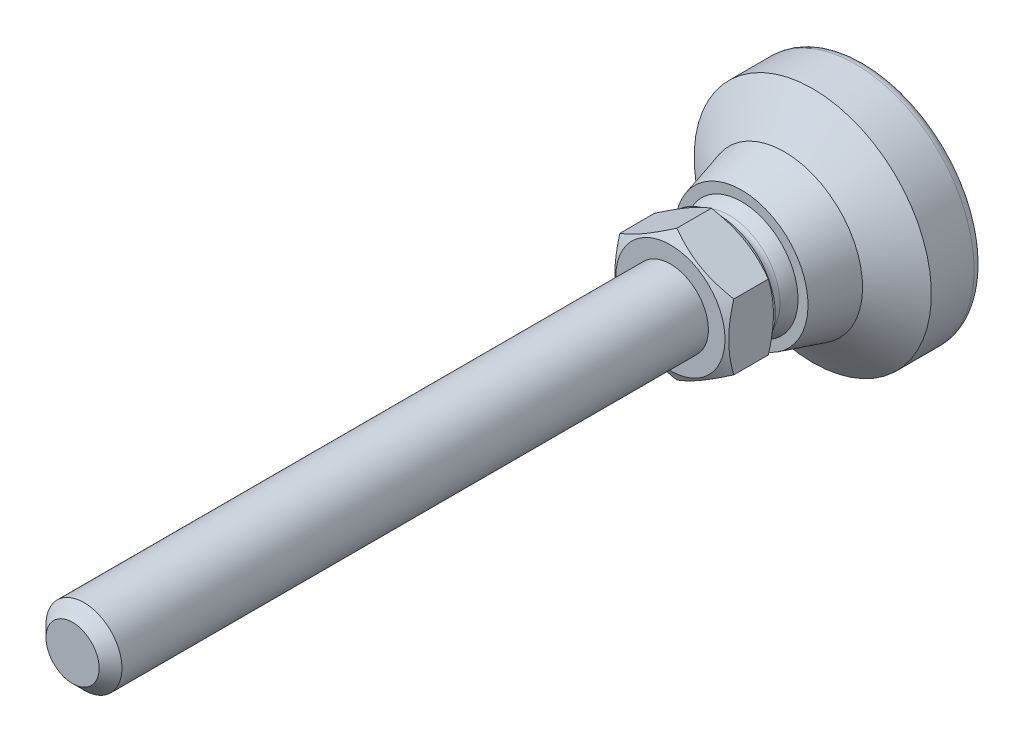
ISO-10303-21;
HEADER;
FILE_DESCRIPTION(('STEP AP214'),'2;1');
FILE_NAME('part.step','',(''),(''),'','','');
FILE_SCHEMA(('AUTOMOTIVE_DESIGN { 1 0 10303 214 1 1 1 1 }'));
ENDSEC;
DATA;
#1=APPLICATION_CONTEXT('core data for automotive mechanical design processes');
#2=APPLICATION_PROTOCOL_DEFINITION('international standard','automotive_design',2000,#1);
#3=PRODUCT_CONTEXT('',#1,'mechanical');
#4=PRODUCT('Part','Part','',(#3));
#5=PRODUCT_RELATED_PRODUCT_CATEGORY('part','',(#4));
#6=PRODUCT_DEFINITION_FORMATION('','',#4);
#7=PRODUCT_DEFINITION_CONTEXT('part definition',#1,'design');
#8=PRODUCT_DEFINITION('design','',#6,#7);
#9=PRODUCT_DEFINITION_SHAPE('','',#8);
#10=(LENGTH_UNIT() NAMED_UNIT(*) SI_UNIT(.MILLI.,.METRE.));
#11=(NAMED_UNIT(*) PLANE_ANGLE_UNIT() SI_UNIT($,.RADIAN.));
#12=(NAMED_UNIT(*) SI_UNIT($,.STERADIAN.) SOLID_ANGLE_UNIT());
#13=UNCERTAINTY_MEASURE_WITH_UNIT(LENGTH_MEASURE(1.E-05),#10,'distance_accuracy_value','');
#14=(GEOMETRIC_REPRESENTATION_CONTEXT(3) GLOBAL_UNCERTAINTY_ASSIGNED_CONTEXT((#13)) GLOBAL_UNIT_ASSIGNED_CONTEXT((#10,
#11,#12)) REPRESENTATION_CONTEXT('',''));
#15=CARTESIAN_POINT('',(0.,0.,0.));
#16=DIRECTION('',(0.,0.,1.));
#17=DIRECTION('',(1.,0.,0.));
#18=AXIS2_PLACEMENT_3D('',#15,#16,#17);
#19=CARTESIAN_POINT('',(0.,0.,14.6997728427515));
#20=DIRECTION('',(0.,0.,-1.));
#21=DIRECTION('',(0.,1.,0.));
#22=AXIS2_PLACEMENT_3D('',#19,#20,#21);
#23=TOROIDAL_SURFACE('',#22,6.05010572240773,0.800227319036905);
#24=CARTESIAN_POINT('',(0.,0.,14.3053528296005));
#25=DIRECTION('',(0.,0.,-1.));
#26=DIRECTION('',(0.,1.,0.));
#27=AXIS2_PLACEMENT_3D('',#24,#25,#26);
#28=CIRCLE('',#27,5.35383234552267);
#29=CARTESIAN_POINT('',(-5.3538323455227,0.,14.3053528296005));
#30=VERTEX_POINT('',#29);
#31=EDGE_CURVE('E163',#30,#30,#28,.T.);
#32=ORIENTED_EDGE('',*,*,#31,.F.);
#33=EDGE_LOOP('',(#32));
#34=FACE_BOUND('',#33,.T.);
#35=CARTESIAN_POINT('',(2.32740595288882,5.58441436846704,15.5000001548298));
#36=CARTESIAN_POINT('',(2.38730882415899,5.5594491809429,15.5000001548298));
#37=CARTESIAN_POINT('',(2.44680968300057,5.5335194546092,15.5000001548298));
#38=CARTESIAN_POINT('',(2.56494646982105,5.47975932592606,15.5000001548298));
#39=CARTESIAN_POINT('',(2.62358239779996,5.45192892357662,15.5000001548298));
#40=CARTESIAN_POINT('',(2.73992841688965,5.39439584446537,15.5000001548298));
#41=CARTESIAN_POINT('',(2.79763850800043,5.36469316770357,15.5000001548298));
#42=CARTESIAN_POINT('',(2.91207314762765,5.30344640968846,15.5000001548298));
#43=CARTESIAN_POINT('',(2.96879769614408,5.27190232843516,15.5000001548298));
#44=CARTESIAN_POINT('',(3.08120249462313,5.20700538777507,15.5000001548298));
#45=CARTESIAN_POINT('',(3.13688274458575,5.17365252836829,15.5000001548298));
#46=CARTESIAN_POINT('',(3.24714131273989,5.10517260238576,15.5000001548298));
#47=CARTESIAN_POINT('',(3.30171963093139,5.07004553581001,15.5000001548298));
#48=CARTESIAN_POINT('',(3.40971774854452,4.99805346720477,15.5000001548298));
#49=CARTESIAN_POINT('',(3.46313754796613,4.96118846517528,15.5000001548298));
#50=CARTESIAN_POINT('',(3.56876357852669,4.88575907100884,15.5000001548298));
#51=CARTESIAN_POINT('',(3.62096980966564,4.8471946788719,15.5000001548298));
#52=CARTESIAN_POINT('',(3.67254173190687,4.80779986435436,15.5000001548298));
#53=B_SPLINE_CURVE_WITH_KNOTS('',3,(#35,#36,#37,#38,#39,#40,#41,#42,#43,#44,#45,#46,#47,#48,#49,
#50,#51,#52),.UNSPECIFIED.,.F.,.F.,(4,2,2,2,2,2,2,2,4),(0.,0.194682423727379,0.389364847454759,
0.58404727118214,0.778729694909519,0.973412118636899,1.16809454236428,1.36277696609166,
1.55745938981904),.UNSPECIFIED.);
#54=CARTESIAN_POINT('',(2.32724464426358,5.58455280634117,15.5000001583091));
#55=VERTEX_POINT('',#54);
#56=CARTESIAN_POINT('',(3.67274227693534,4.80772938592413,15.5000001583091));
#57=VERTEX_POINT('',#56);
#58=EDGE_CURVE('E109',#55,#57,#53,.T.);
#59=ORIENTED_EDGE('',*,*,#58,.T.);
#60=CARTESIAN_POINT('',(0.,0.,15.5000001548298));
#61=DIRECTION('',(0.,0.,-1.));
#62=DIRECTION('',(0.,1.,0.));
#63=AXIS2_PLACEMENT_3D('',#60,#61,#62);
#64=CIRCLE('',#63,6.05000019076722);
#65=CARTESIAN_POINT('',(5.99998692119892,0.7768234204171,15.5000001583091));
#66=VERTEX_POINT('',#65);
#67=EDGE_CURVE('E169',#57,#66,#64,.T.);
#68=ORIENTED_EDGE('',*,*,#67,.T.);
#69=CARTESIAN_POINT('',(5.99994768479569,0.776614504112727,15.5000001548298));
#70=CARTESIAN_POINT('',(6.00827863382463,0.712254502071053,15.5000001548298));
#71=CARTESIAN_POINT('',(6.01557326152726,0.647760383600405,15.5000001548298));
#72=CARTESIAN_POINT('',(6.02808401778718,0.518570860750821,15.5000001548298));
#73=CARTESIAN_POINT('',(6.03330014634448,0.453875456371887,15.5000001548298));
#74=CARTESIAN_POINT('',(6.04164804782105,0.324350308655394,15.5000001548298));
#75=CARTESIAN_POINT('',(6.04477982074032,0.259520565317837,15.5000001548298));
#76=CARTESIAN_POINT('',(6.04895589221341,0.129793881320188,15.5000001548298));
#77=CARTESIAN_POINT('',(6.05000019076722,0.064896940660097,15.5000001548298));
#78=CARTESIAN_POINT('',(6.05000019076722,-0.0648969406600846,15.5000001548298));
#79=CARTESIAN_POINT('',(6.04895589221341,-0.129793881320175,15.5000001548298));
#80=CARTESIAN_POINT('',(6.04477982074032,-0.259520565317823,15.5000001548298));
#81=CARTESIAN_POINT('',(6.04164804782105,-0.324350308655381,15.5000001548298));
#82=CARTESIAN_POINT('',(6.03330014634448,-0.453875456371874,15.5000001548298));
#83=CARTESIAN_POINT('',(6.02808401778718,-0.518570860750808,15.5000001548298));
#84=CARTESIAN_POINT('',(6.01557326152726,-0.647760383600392,15.5000001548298));
#85=CARTESIAN_POINT('',(6.00827863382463,-0.71225450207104,15.5000001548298));
#86=CARTESIAN_POINT('',(5.99994768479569,-0.776614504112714,15.5000001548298));
#87=B_SPLINE_CURVE_WITH_KNOTS('',3,(#69,#70,#71,#72,#73,#74,#75,#76,#77,#78,#79,#80,#81,#82,#83,
#84,#85,#86),.UNSPECIFIED.,.F.,.F.,(4,2,2,2,2,2,2,2,4),(0.,0.194682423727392,0.389364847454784,
0.584047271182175,0.778729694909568,0.973412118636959,1.16809454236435,1.36277696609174,
1.55745938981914),.UNSPECIFIED.);
#88=CARTESIAN_POINT('',(5.99998692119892,-0.776823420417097,15.5000001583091));
#89=VERTEX_POINT('',#88);
#90=EDGE_CURVE('E615',#66,#89,#87,.T.);
#91=ORIENTED_EDGE('',*,*,#90,.T.);
#92=CARTESIAN_POINT('',(3.67274227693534,-4.80772938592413,15.5000001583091));
#93=VERTEX_POINT('',#92);
#94=EDGE_CURVE('E179',#89,#93,#64,.T.);
#95=ORIENTED_EDGE('',*,*,#94,.T.);
#96=CARTESIAN_POINT('',(3.67254173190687,-4.80779986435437,15.5000001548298));
#97=CARTESIAN_POINT('',(3.62096980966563,-4.8471946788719,15.5000001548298));
#98=CARTESIAN_POINT('',(3.56876357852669,-4.88575907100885,15.5000001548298));
#99=CARTESIAN_POINT('',(3.46313754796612,-4.96118846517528,15.5000001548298));
#100=CARTESIAN_POINT('',(3.40971774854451,-4.99805346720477,15.5000001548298));
#101=CARTESIAN_POINT('',(3.30171963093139,-5.07004553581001,15.5000001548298));
#102=CARTESIAN_POINT('',(3.24714131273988,-5.10517260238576,15.5000001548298));
#103=CARTESIAN_POINT('',(3.13688274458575,-5.17365252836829,15.5000001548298));
#104=CARTESIAN_POINT('',(3.08120249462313,-5.20700538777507,15.5000001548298));
#105=CARTESIAN_POINT('',(2.96879769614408,-5.27190232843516,15.5000001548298));
#106=CARTESIAN_POINT('',(2.91207314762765,-5.30344640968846,15.5000001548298));
#107=CARTESIAN_POINT('',(2.79763850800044,-5.36469316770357,15.5000001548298));
#108=CARTESIAN_POINT('',(2.73992841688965,-5.39439584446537,15.5000001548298));
#109=CARTESIAN_POINT('',(2.62358239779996,-5.45192892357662,15.5000001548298));
#110=CARTESIAN_POINT('',(2.56494646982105,-5.47975932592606,15.5000001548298));
#111=CARTESIAN_POINT('',(2.44680968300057,-5.5335194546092,15.5000001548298));
#112=CARTESIAN_POINT('',(2.387308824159,-5.5594491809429,15.5000001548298));
#113=CARTESIAN_POINT('',(2.32740595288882,-5.58441436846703,15.5000001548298));
#114=B_SPLINE_CURVE_WITH_KNOTS('',3,(#96,#97,#98,#99,#100,#101,#102,#103,#104,#105,#106,#107,
#108,#109,#110,#111,#112,#113),.UNSPECIFIED.,.F.,.F.,(4,2,2,2,2,2,2,2,4),(0.,0.194682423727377,
0.389364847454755,0.584047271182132,0.778729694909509,0.973412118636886,1.16809454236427,
1.36277696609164,1.55745938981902),.UNSPECIFIED.);
#115=CARTESIAN_POINT('',(2.32724464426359,-5.58455280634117,15.5000001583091));
#116=VERTEX_POINT('',#115);
#117=EDGE_CURVE('E262',#93,#116,#114,.T.);
#118=ORIENTED_EDGE('',*,*,#117,.T.);
#119=CARTESIAN_POINT('',(-2.32724464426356,-5.58455280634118,15.5000001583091));
#120=VERTEX_POINT('',#119);
#121=EDGE_CURVE('E181',#116,#120,#64,.T.);
#122=ORIENTED_EDGE('',*,*,#121,.T.);
#123=CARTESIAN_POINT('',(-2.32740595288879,-5.58441436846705,15.5000001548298));
#124=CARTESIAN_POINT('',(-2.38730882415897,-5.55944918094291,15.5000001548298));
#125=CARTESIAN_POINT('',(-2.44680968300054,-5.53351945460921,15.5000001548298));
#126=CARTESIAN_POINT('',(-2.56494646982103,-5.47975932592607,15.5000001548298));
#127=CARTESIAN_POINT('',(-2.62358239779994,-5.45192892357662,15.5000001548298));
#128=CARTESIAN_POINT('',(-2.73992841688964,-5.39439584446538,15.5000001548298));
#129=CARTESIAN_POINT('',(-2.79763850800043,-5.36469316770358,15.5000001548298));
#130=CARTESIAN_POINT('',(-2.91207314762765,-5.30344640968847,15.5000001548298));
#131=CARTESIAN_POINT('',(-2.96879769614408,-5.27190232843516,15.5000001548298));
#132=CARTESIAN_POINT('',(-3.08120249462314,-5.20700538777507,15.5000001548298));
#133=CARTESIAN_POINT('',(-3.13688274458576,-5.17365252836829,15.5000001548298));
#134=CARTESIAN_POINT('',(-3.2471413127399,-5.10517260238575,15.5000001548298));
#135=CARTESIAN_POINT('',(-3.30171963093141,-5.07004553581,15.5000001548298));
#136=CARTESIAN_POINT('',(-3.40971774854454,-4.99805346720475,15.5000001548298));
#137=CARTESIAN_POINT('',(-3.46313754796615,-4.96118846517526,15.5000001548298));
#138=CARTESIAN_POINT('',(-3.56876357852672,-4.88575907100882,15.5000001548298));
#139=CARTESIAN_POINT('',(-3.62096980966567,-4.84719467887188,15.5000001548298));
#140=CARTESIAN_POINT('',(-3.67254173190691,-4.80779986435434,15.5000001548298));
#141=B_SPLINE_CURVE_WITH_KNOTS('',3,(#123,#124,#125,#126,#127,#128,#129,#130,#131,#132,#133,
#134,#135,#136,#137,#138,#139,#140),.UNSPECIFIED.,.F.,.F.,(4,2,2,2,2,2,2,2,4),(0.,
0.194682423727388,0.389364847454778,0.584047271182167,0.778729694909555,0.973412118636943,
1.16809454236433,1.36277696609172,1.55745938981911),.UNSPECIFIED.);
#142=CARTESIAN_POINT('',(-3.67274227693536,-4.80772938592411,15.5000001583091));
#143=VERTEX_POINT('',#142);
#144=EDGE_CURVE('E148',#120,#143,#141,.T.);
#145=ORIENTED_EDGE('',*,*,#144,.T.);
#146=CARTESIAN_POINT('',(-5.99999019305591,-0.776824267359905,15.5000001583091));
#147=VERTEX_POINT('',#146);
#148=EDGE_CURVE('E183',#143,#147,#64,.T.);
#149=ORIENTED_EDGE('',*,*,#148,.T.);
#150=CARTESIAN_POINT('',(-5.99994768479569,-0.776614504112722,15.5000001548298));
#151=CARTESIAN_POINT('',(-6.00827863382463,-0.712254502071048,15.5000001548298));
#152=CARTESIAN_POINT('',(-6.01557326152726,-0.647760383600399,15.5000001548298));
#153=CARTESIAN_POINT('',(-6.02808401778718,-0.518570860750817,15.5000001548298));
#154=CARTESIAN_POINT('',(-6.03330014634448,-0.453875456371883,15.5000001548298));
#155=CARTESIAN_POINT('',(-6.04164804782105,-0.32435030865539,15.5000001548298));
#156=CARTESIAN_POINT('',(-6.04477982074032,-0.25952056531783,15.5000001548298));
#157=CARTESIAN_POINT('',(-6.04895589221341,-0.12979388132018,15.5000001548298));
#158=CARTESIAN_POINT('',(-6.05000019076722,-0.0648969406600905,15.5000001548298));
#159=CARTESIAN_POINT('',(-6.05000019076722,0.0648969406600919,15.5000001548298));
#160=CARTESIAN_POINT('',(-6.04895589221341,0.129793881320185,15.5000001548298));
#161=CARTESIAN_POINT('',(-6.04477982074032,0.259520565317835,15.5000001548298));
#162=CARTESIAN_POINT('',(-6.04164804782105,0.324350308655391,15.5000001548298));
#163=CARTESIAN_POINT('',(-6.03330014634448,0.453875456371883,15.5000001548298));
#164=CARTESIAN_POINT('',(-6.02808401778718,0.518570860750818,15.5000001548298));
#165=CARTESIAN_POINT('',(-6.01557326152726,0.647760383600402,15.5000001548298));
#166=CARTESIAN_POINT('',(-6.00827863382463,0.712254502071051,15.5000001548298));
#167=CARTESIAN_POINT('',(-5.99994768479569,0.776614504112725,15.5000001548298));
#168=B_SPLINE_CURVE_WITH_KNOTS('',3,(#150,#151,#152,#153,#154,#155,#156,#157,#158,#159,#160,
#161,#162,#163,#164,#165,#166,#167),.UNSPECIFIED.,.F.,.F.,(4,2,2,2,2,2,2,2,4),(0.,
0.194682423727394,0.389364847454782,0.58404727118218,0.778729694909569,0.973412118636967,
1.16809454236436,1.36277696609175,1.55745938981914),.UNSPECIFIED.);
#169=CARTESIAN_POINT('',(-5.99998692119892,0.776823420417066,15.5000001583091));
#170=VERTEX_POINT('',#169);
#171=EDGE_CURVE('E121',#147,#170,#168,.T.);
#172=ORIENTED_EDGE('',*,*,#171,.T.);
#173=CARTESIAN_POINT('',(-3.67274464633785,4.80773179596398,15.5000001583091));
#174=VERTEX_POINT('',#173);
#175=EDGE_CURVE('E185',#170,#174,#64,.T.);
#176=ORIENTED_EDGE('',*,*,#175,.T.);
#177=CARTESIAN_POINT('',(-3.67254173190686,4.80779986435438,15.5000001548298));
#178=CARTESIAN_POINT('',(-3.62096980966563,4.84719467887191,15.5000001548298));
#179=CARTESIAN_POINT('',(-3.56876357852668,4.88575907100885,15.5000001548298));
#180=CARTESIAN_POINT('',(-3.46313754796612,4.96118846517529,15.5000001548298));
#181=CARTESIAN_POINT('',(-3.4097177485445,4.99805346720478,15.5000001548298));
#182=CARTESIAN_POINT('',(-3.30171963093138,5.07004553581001,15.5000001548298));
#183=CARTESIAN_POINT('',(-3.24714131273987,5.10517260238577,15.5000001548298));
#184=CARTESIAN_POINT('',(-3.13688274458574,5.1736525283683,15.5000001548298));
#185=CARTESIAN_POINT('',(-3.08120249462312,5.20700538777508,15.5000001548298));
#186=CARTESIAN_POINT('',(-2.96879769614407,5.27190232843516,15.5000001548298));
#187=CARTESIAN_POINT('',(-2.91207314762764,5.30344640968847,15.5000001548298));
#188=CARTESIAN_POINT('',(-2.79763850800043,5.36469316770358,15.5000001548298));
#189=CARTESIAN_POINT('',(-2.73992841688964,5.39439584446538,15.5000001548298));
#190=CARTESIAN_POINT('',(-2.62358239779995,5.45192892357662,15.5000001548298));
#191=CARTESIAN_POINT('',(-2.56494646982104,5.47975932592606,15.5000001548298));
#192=CARTESIAN_POINT('',(-2.44680968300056,5.5335194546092,15.5000001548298));
#193=CARTESIAN_POINT('',(-2.38730882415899,5.5594491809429,15.5000001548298));
#194=CARTESIAN_POINT('',(-2.32740595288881,5.58441436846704,15.5000001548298));
#195=B_SPLINE_CURVE_WITH_KNOTS('',3,(#177,#178,#179,#180,#181,#182,#183,#184,#185,#186,#187,
#188,#189,#190,#191,#192,#193,#194),.UNSPECIFIED.,.F.,.F.,(4,2,2,2,2,2,2,2,4),(0.,
0.194682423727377,0.389364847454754,0.584047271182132,0.778729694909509,0.973412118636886,
1.16809454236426,1.36277696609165,1.55745938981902),.UNSPECIFIED.);
#196=CARTESIAN_POINT('',(-2.32724464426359,5.58455280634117,15.5000001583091));
#197=VERTEX_POINT('',#196);
#198=EDGE_CURVE('E124',#174,#197,#195,.T.);
#199=ORIENTED_EDGE('',*,*,#198,.T.);
#200=EDGE_CURVE('E166',#197,#55,#64,.T.);
#201=ORIENTED_EDGE('',*,*,#200,.T.);
#202=EDGE_LOOP('',(#59,#68,#91,#95,#118,#122,#145,#149,#172,#176,#199,#201));
#203=FACE_BOUND('',#202,.T.);
#204=ADVANCED_FACE('F14',(#34,#203),#23,.F.);
#205=CARTESIAN_POINT('',(0.,0.,11.080608));
#206=DIRECTION('',(0.,0.,-1.));
#207=DIRECTION('',(-1.,0.,0.));
#208=AXIS2_PLACEMENT_3D('',#205,#206,#207);
#209=SPHERICAL_SURFACE('',#208,6.25);
#210=CARTESIAN_POINT('',(0.,0.,13.0000001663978));
#211=DIRECTION('',(0.,0.,-1.));
#212=DIRECTION('',(0.,1.,0.));
#213=AXIS2_PLACEMENT_3D('',#210,#211,#212);
#214=CIRCLE('',#213,5.94797727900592);
#215=CARTESIAN_POINT('',(-5.94797727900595,0.,13.0000001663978));
#216=VERTEX_POINT('',#215);
#217=EDGE_CURVE('E160',#216,#216,#214,.T.);
#218=CARTESIAN_POINT('',(-5.94797727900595,0.,13.0000001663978));
#219=CARTESIAN_POINT('',(-5.94337913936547,0.,13.0142492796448));
#220=CARTESIAN_POINT('',(-5.9387297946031,0.,13.028481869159));
#221=CARTESIAN_POINT('',(-5.92932893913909,0.,13.0569132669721));
#222=CARTESIAN_POINT('',(-5.92457742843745,0.,13.0711120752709));
#223=CARTESIAN_POINT('',(-5.91497248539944,0.,13.0994751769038));
#224=CARTESIAN_POINT('',(-5.91011905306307,0.,13.1136394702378));
#225=CARTESIAN_POINT('',(-5.90031051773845,0.,13.1419328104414));
#226=CARTESIAN_POINT('',(-5.8953554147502,0.,13.1560618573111));
#227=CARTESIAN_POINT('',(-5.88534379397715,0.,13.1842839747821));
#228=CARTESIAN_POINT('',(-5.88028727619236,0.,13.1983770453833));
#229=CARTESIAN_POINT('',(-5.87007308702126,0.,13.2265264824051));
#230=CARTESIAN_POINT('',(-5.86491541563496,0.,13.2405828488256));
#231=CARTESIAN_POINT('',(-5.85449918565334,0.,13.2686581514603));
#232=CARTESIAN_POINT('',(-5.84924062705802,0.,13.2826770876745));
#233=CARTESIAN_POINT('',(-5.83862289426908,0.,13.3106768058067));
#234=CARTESIAN_POINT('',(-5.83326372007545,0.,13.3246575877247));
#235=CARTESIAN_POINT('',(-5.82244503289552,0.,13.3525802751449));
#236=CARTESIAN_POINT('',(-5.81698551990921,0.,13.366522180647));
#237=CARTESIAN_POINT('',(-5.80596643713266,0.,13.3943663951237));
#238=CARTESIAN_POINT('',(-5.80040686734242,0.,13.4082687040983));
#239=CARTESIAN_POINT('',(-5.78918795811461,0.,13.4360330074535));
#240=CARTESIAN_POINT('',(-5.78352861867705,0.,13.4498950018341));
#241=CARTESIAN_POINT('',(-5.77211046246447,0.,13.4775779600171));
#242=CARTESIAN_POINT('',(-5.76635164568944,0.,13.4913989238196));
#243=CARTESIAN_POINT('',(-5.75473483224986,0.,13.5189991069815));
#244=CARTESIAN_POINT('',(-5.7488768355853,0.,13.532778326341));
#245=CARTESIAN_POINT('',(-5.73706196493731,0.,13.560294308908));
#246=CARTESIAN_POINT('',(-5.73110509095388,0.,13.5740310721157));
#247=CARTESIAN_POINT('',(-5.71909277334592,0.,13.6014614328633));
#248=CARTESIAN_POINT('',(-5.71303732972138,0.,13.6151550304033));
#249=CARTESIAN_POINT('',(-5.70082818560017,0.,13.6424983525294));
#250=CARTESIAN_POINT('',(-5.69467448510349,0.,13.6561480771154));
#251=CARTESIAN_POINT('',(-5.68226914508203,0.,13.6834029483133));
#252=CARTESIAN_POINT('',(-5.67601750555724,0.,13.6970080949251));
#253=CARTESIAN_POINT('',(-5.66341661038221,0.,13.7241731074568));
#254=CARTESIAN_POINT('',(-5.65706735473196,0.,13.7377329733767));
#255=CARTESIAN_POINT('',(-5.64427155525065,0.,13.7648067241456));
#256=CARTESIAN_POINT('',(-5.63782501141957,0.,13.7783206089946));
#257=CARTESIAN_POINT('',(-5.62483496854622,0.,13.8053016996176));
#258=CARTESIAN_POINT('',(-5.61829146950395,0.,13.8187689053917));
#259=CARTESIAN_POINT('',(-5.60510785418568,0.,13.845655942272));
#260=CARTESIAN_POINT('',(-5.59846773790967,0.,13.8590757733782));
#261=CARTESIAN_POINT('',(-5.58509123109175,0.,13.8858673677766));
#262=CARTESIAN_POINT('',(-5.57835484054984,0.,13.8992391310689));
#263=CARTESIAN_POINT('',(-5.56478613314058,0.,13.9259338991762));
#264=CARTESIAN_POINT('',(-5.55795381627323,0.,13.9392569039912));
#265=CARTESIAN_POINT('',(-5.54419360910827,0.,13.9658534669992));
#266=CARTESIAN_POINT('',(-5.53726571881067,0.,13.9791270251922));
#267=CARTESIAN_POINT('',(-5.5233147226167,0.,14.005624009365));
#268=CARTESIAN_POINT('',(-5.51629161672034,0.,14.0188474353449));
#269=CARTESIAN_POINT('',(-5.50215055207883,0.,14.0452434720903));
#270=CARTESIAN_POINT('',(-5.49503259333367,0.,14.0584160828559));
#271=CARTESIAN_POINT('',(-5.48070219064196,0.,14.0847098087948));
#272=CARTESIAN_POINT('',(-5.4734897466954,0.,14.0978309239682));
#273=CARTESIAN_POINT('',(-5.45897074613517,0.,14.124020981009));
#274=CARTESIAN_POINT('',(-5.45166418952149,0.,14.1370899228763));
#275=CARTESIAN_POINT('',(-5.43695734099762,0.,14.163174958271));
#276=CARTESIAN_POINT('',(-5.42955704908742,0.,14.1761910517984));
#277=CARTESIAN_POINT('',(-5.41466311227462,0.,14.2021697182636));
#278=CARTESIAN_POINT('',(-5.40716946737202,0.,14.2151322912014));
#279=CARTESIAN_POINT('',(-5.39208921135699,0.,14.2410032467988));
#280=CARTESIAN_POINT('',(-5.38450260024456,0.,14.2539116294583));
#281=CARTESIAN_POINT('',(-5.36923680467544,0.,14.2796735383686));
#282=CARTESIAN_POINT('',(-5.36155762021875,0.,14.2925270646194));
#283=CARTESIAN_POINT('',(-5.3538323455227,0.,14.3053528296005));
#284=B_SPLINE_CURVE_WITH_KNOTS('',3,(#218,#219,#220,#221,#222,#223,#224,#225,#226,#227,#228,
#229,#230,#231,#232,#233,#234,#235,#236,#237,#238,#239,#240,#241,#242,#243,#244,#245,#246,#247,
#248,#249,#250,#251,#252,#253,#254,#255,#256,#257,#258,#259,#260,#261,#262,#263,#264,#265,#266,
#267,#268,#269,#270,#271,#272,#273,#274,#275,#276,#277,#278,#279,#280,#281,#282,#283),
.UNSPECIFIED.,.F.,.F.,(4,2,2,2,2,2,2,2,2,2,2,2,2,2,2,2,2,2,2,2,2,2,2,2,2,2,2,2,2,2,2,2,4),(0.,
0.0449178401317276,0.0898356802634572,0.134753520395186,0.179671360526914,0.224589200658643,
0.269507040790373,0.314424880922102,0.359342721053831,0.40426056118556,0.449178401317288,
0.494096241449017,0.539014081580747,0.583931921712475,0.628849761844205,0.673767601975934,
0.718685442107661,0.76360328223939,0.80852112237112,0.853438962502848,0.898356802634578,
0.943274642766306,0.988192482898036,1.03311032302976,1.07802816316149,1.12294600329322,
1.16786384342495,1.21278168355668,1.25769952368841,1.30261736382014,1.34753520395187,
1.3924530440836,1.43737088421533),.UNSPECIFIED.);
#285=EDGE_CURVE('BSEAM280',#216,#30,#284,.T.);
#286=ORIENTED_EDGE('',*,*,#217,.F.);
#287=ORIENTED_EDGE('',*,*,#31,.T.);
#288=ORIENTED_EDGE('',*,*,#285,.T.);
#289=ORIENTED_EDGE('',*,*,#285,.F.);
#290=EDGE_LOOP('',(#286,#288,#287,#289));
#291=FACE_BOUND('',#290,.T.);
#292=ADVANCED_FACE('F280',(#291),#209,.T.);
#293=CARTESIAN_POINT('',(-6.35,0.,13.));
#294=DIRECTION('',(0.,0.,-1.));
#295=DIRECTION('',(0.,1.,0.));
#296=AXIS2_PLACEMENT_3D('',#293,#294,#295);
#297=PLANE('',#296);
#298=CARTESIAN_POINT('',(0.,0.,13.));
#299=DIRECTION('',(0.,0.,-1.));
#300=DIRECTION('',(0.,1.,0.));
#301=AXIS2_PLACEMENT_3D('',#298,#299,#300);
#302=CIRCLE('',#301,7.);
#303=CARTESIAN_POINT('',(0.,7.,13.));
#304=VERTEX_POINT('',#303);
#305=EDGE_CURVE('E157',#304,#304,#302,.T.);
#306=ORIENTED_EDGE('',*,*,#305,.F.);
#307=EDGE_LOOP('',(#306));
#308=FACE_BOUND('',#307,.T.);
#309=ORIENTED_EDGE('',*,*,#217,.T.);
#310=EDGE_LOOP('',(#309));
#311=FACE_BOUND('',#310,.T.);
#312=ADVANCED_FACE('F565',(#308,#311),#297,.F.);
#313=CARTESIAN_POINT('',(0.,0.,13.));
#314=DIRECTION('',(0.,0.,-1.));
#315=DIRECTION('',(0.,1.,0.));
#316=AXIS2_PLACEMENT_3D('',#313,#314,#315);
#317=CONICAL_SURFACE('',#316,7.,0.270946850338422);
#318=CARTESIAN_POINT('',(0.,0.,8.5));
#319=DIRECTION('',(0.,0.,-1.));
#320=DIRECTION('',(0.,1.,0.));
#321=AXIS2_PLACEMENT_3D('',#318,#319,#320);
#322=CIRCLE('',#321,8.25);
#323=CARTESIAN_POINT('',(0.,8.25,8.5));
#324=VERTEX_POINT('',#323);
#325=EDGE_CURVE('E154',#324,#324,#322,.T.);
#326=ORIENTED_EDGE('',*,*,#325,.F.);
#327=EDGE_LOOP('',(#326));
#328=FACE_BOUND('',#327,.T.);
#329=ORIENTED_EDGE('',*,*,#305,.T.);
#330=EDGE_LOOP('',(#329));
#331=FACE_BOUND('',#330,.T.);
#332=ADVANCED_FACE('F555',(#328,#331),#317,.T.);
#333=CARTESIAN_POINT('',(0.,0.,8.5));
#334=DIRECTION('',(0.,0.,-1.));
#335=DIRECTION('',(0.,1.,0.));
#336=AXIS2_PLACEMENT_3D('',#333,#334,#335);
#337=CONICAL_SURFACE('',#336,8.25,0.956133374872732);
#338=CARTESIAN_POINT('',(0.,0.,5.5));
#339=DIRECTION('',(0.,0.,-1.));
#340=DIRECTION('',(0.,1.,0.));
#341=AXIS2_PLACEMENT_3D('',#338,#339,#340);
#342=CIRCLE('',#341,12.5);
#343=CARTESIAN_POINT('',(0.,12.5,5.5));
#344=VERTEX_POINT('',#343);
#345=EDGE_CURVE('E151',#344,#344,#342,.T.);
#346=ORIENTED_EDGE('',*,*,#345,.F.);
#347=EDGE_LOOP('',(#346));
#348=FACE_BOUND('',#347,.T.);
#349=ORIENTED_EDGE('',*,*,#325,.T.);
#350=EDGE_LOOP('',(#349));
#351=FACE_BOUND('',#350,.T.);
#352=ADVANCED_FACE('F545',(#348,#351),#337,.T.);
#353=CARTESIAN_POINT('',(0.,0.,0.));
#354=DIRECTION('',(0.,0.,-1.));
#355=DIRECTION('',(0.,1.,0.));
#356=AXIS2_PLACEMENT_3D('',#353,#354,#355);
#357=CYLINDRICAL_SURFACE('',#356,12.5);
#358=CARTESIAN_POINT('',(0.,0.,1.));
#359=DIRECTION('',(0.,0.,-1.));
#360=DIRECTION('',(0.,1.,0.));
#361=AXIS2_PLACEMENT_3D('',#358,#359,#360);
#362=CIRCLE('',#361,12.5);
#363=CARTESIAN_POINT('',(0.,12.5,1.));
#364=VERTEX_POINT('',#363);
#365=EDGE_CURVE('E147',#364,#364,#362,.T.);
#366=ORIENTED_EDGE('',*,*,#365,.F.);
#367=EDGE_LOOP('',(#366));
#368=FACE_BOUND('',#367,.T.);
#369=ORIENTED_EDGE('',*,*,#345,.T.);
#370=EDGE_LOOP('',(#369));
#371=FACE_BOUND('',#370,.T.);
#372=ADVANCED_FACE('F536',(#368,#371),#357,.T.);
#373=CARTESIAN_POINT('',(0.,0.,1.));
#374=DIRECTION('',(0.,0.,-1.));
#375=DIRECTION('',(0.,1.,0.));
#376=AXIS2_PLACEMENT_3D('',#373,#374,#375);
#377=TOROIDAL_SURFACE('',#376,11.5,1.);
#378=CARTESIAN_POINT('',(0.,0.,0.));
#379=DIRECTION('',(0.,0.,-1.));
#380=DIRECTION('',(0.,1.,0.));
#381=AXIS2_PLACEMENT_3D('',#378,#379,#380);
#382=CIRCLE('',#381,11.5);
#383=CARTESIAN_POINT('',(0.,11.5,0.));
#384=VERTEX_POINT('',#383);
#385=EDGE_CURVE('E144',#384,#384,#382,.T.);
#386=ORIENTED_EDGE('',*,*,#385,.F.);
#387=EDGE_LOOP('',(#386));
#388=FACE_BOUND('',#387,.T.);
#389=ORIENTED_EDGE('',*,*,#365,.T.);
#390=EDGE_LOOP('',(#389));
#391=FACE_BOUND('',#390,.T.);
#392=ADVANCED_FACE('F527',(#388,#391),#377,.T.);
#393=CARTESIAN_POINT('',(-11.5,0.,0.));
#394=DIRECTION('',(0.,0.,1.));
#395=DIRECTION('',(0.,-1.,0.));
#396=AXIS2_PLACEMENT_3D('',#393,#394,#395);
#397=PLANE('',#396);
#398=ORIENTED_EDGE('',*,*,#385,.T.);
#399=EDGE_LOOP('',(#398));
#400=FACE_BOUND('',#399,.T.);
#401=ADVANCED_FACE('F218',(#400),#397,.F.);
#402=CARTESIAN_POINT('',(0.,5.75,15.5000001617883));
#403=DIRECTION('',(0.,0.,-1.));
#404=DIRECTION('',(-1.,0.,0.));
#405=AXIS2_PLACEMENT_3D('',#402,#403,#404);
#406=PLANE('',#405);
#407=ORIENTED_EDGE('',*,*,#144,.F.);
#408=ORIENTED_EDGE('',*,*,#121,.F.);
#409=ORIENTED_EDGE('',*,*,#117,.F.);
#410=ORIENTED_EDGE('',*,*,#94,.F.);
#411=ORIENTED_EDGE('',*,*,#90,.F.);
#412=ORIENTED_EDGE('',*,*,#67,.F.);
#413=ORIENTED_EDGE('',*,*,#58,.F.);
#414=ORIENTED_EDGE('',*,*,#200,.F.);
#415=ORIENTED_EDGE('',*,*,#198,.F.);
#416=ORIENTED_EDGE('',*,*,#175,.F.);
#417=ORIENTED_EDGE('',*,*,#171,.F.);
#418=ORIENTED_EDGE('',*,*,#148,.F.);
#419=EDGE_LOOP('',(#407,#408,#409,#410,#411,#412,#413,#414,#415,#416,#417,#418));
#420=FACE_BOUND('',#419,.T.);
#421=CARTESIAN_POINT('',(0.,0.,15.5000001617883));
#422=DIRECTION('',(0.,0.,-1.));
#423=DIRECTION('',(-1.,0.,0.));
#424=AXIS2_PLACEMENT_3D('',#421,#422,#423);
#425=CIRCLE('',#424,5.75);
#426=CARTESIAN_POINT('',(-5.75,0.,15.5000001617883));
#427=VERTEX_POINT('',#426);
#428=EDGE_CURVE('E115',#427,#427,#425,.T.);
#429=ORIENTED_EDGE('',*,*,#428,.T.);
#430=EDGE_LOOP('',(#429));
#431=FACE_BOUND('',#430,.T.);
#432=ADVANCED_FACE('F194',(#420,#431),#406,.F.);
#433=CARTESIAN_POINT('',(0.,0.,17.1389308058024));
#434=DIRECTION('',(0.,0.,1.));
#435=DIRECTION('',(1.,0.,0.));
#436=AXIS2_PLACEMENT_3D('',#433,#434,#435);
#437=CONICAL_SURFACE('',#436,8.58871114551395,1.0471975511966);
#438=CARTESIAN_POINT('',(-6.0002,3.46398614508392,16.1803027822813));
#439=CARTESIAN_POINT('',(-5.86831298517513,3.54013114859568,16.1363467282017));
#440=CARTESIAN_POINT('',(-5.73593423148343,3.61656005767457,16.0943855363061));
#441=CARTESIAN_POINT('',(-5.47010166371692,3.77003856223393,16.0150023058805));
#442=CARTESIAN_POINT('',(-5.33664741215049,3.84708841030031,15.9775822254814));
#443=CARTESIAN_POINT('',(-4.93414786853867,4.07947163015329,15.8728681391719));
#444=CARTESIAN_POINT('',(-4.66351376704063,4.23572230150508,15.8133077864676));
#445=CARTESIAN_POINT('',(-4.25851475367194,4.46954859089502,15.743465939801));
#446=CARTESIAN_POINT('',(-4.12535995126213,4.54642555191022,15.7235699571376));
#447=CARTESIAN_POINT('',(-3.85844867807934,4.70052684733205,15.6902071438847));
#448=CARTESIAN_POINT('',(-3.72469226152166,4.77775115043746,15.6767397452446));
#449=CARTESIAN_POINT('',(-3.45694711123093,4.93233388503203,15.6565773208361));
#450=CARTESIAN_POINT('',(-3.32295881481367,5.0096920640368,15.6498746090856));
#451=CARTESIAN_POINT('',(-3.05486583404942,5.16447561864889,15.6433780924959));
#452=CARTESIAN_POINT('',(-2.92076115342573,5.24190099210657,15.6435840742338));
#453=CARTESIAN_POINT('',(-2.55335498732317,5.45402304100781,15.6536449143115));
#454=CARTESIAN_POINT('',(-2.3201737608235,5.58865028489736,15.670535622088));
#455=CARTESIAN_POINT('',(-1.85536008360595,5.85701058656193,15.7240969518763));
#456=CARTESIAN_POINT('',(-1.62372926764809,5.99074270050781,15.7607858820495));
#457=CARTESIAN_POINT('',(-1.15798010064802,6.25964310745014,15.8524978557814));
#458=CARTESIAN_POINT('',(-0.923920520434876,6.39477746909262,15.9079094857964));
#459=CARTESIAN_POINT('',(-0.45929191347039,6.66303092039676,16.0336716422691));
#460=CARTESIAN_POINT('',(-0.22871693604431,6.7961534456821,16.1039926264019));
#461=CARTESIAN_POINT('',(0.000199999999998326,6.92831870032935,16.1803027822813));
#462=B_SPLINE_CURVE_WITH_KNOTS('',3,(#438,#439,#440,#441,#442,#443,#444,#445,#446,#447,#448,
#449,#450,#451,#452,#453,#454,#455,#456,#457,#458,#459,#460,#461),.UNSPECIFIED.,.F.,.F.,(4,2,2,
2,2,2,2,2,2,2,2,4),(0.,0.475482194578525,0.951168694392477,1.90451835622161,2.36951738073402,
2.83447530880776,3.29890435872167,3.76331906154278,4.57182194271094,5.38107376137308,
6.20827406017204,7.03385036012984),.UNSPECIFIED.);
#463=CARTESIAN_POINT('',(-6.,3.46410161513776,16.180236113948));
#464=VERTEX_POINT('',#463);
#465=CARTESIAN_POINT('',(0.,6.92820323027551,16.180236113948));
#466=VERTEX_POINT('',#465);
#467=EDGE_CURVE('E29',#464,#466,#462,.T.);
#468=ORIENTED_EDGE('',*,*,#467,.T.);
#469=CARTESIAN_POINT('',(-0.000200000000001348,6.92831870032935,16.1803027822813));
#470=CARTESIAN_POINT('',(0.131687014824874,6.85217369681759,16.1363467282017));
#471=CARTESIAN_POINT('',(0.264065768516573,6.7757447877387,16.0943855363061));
#472=CARTESIAN_POINT('',(0.529898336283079,6.62226628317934,16.0150023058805));
#473=CARTESIAN_POINT('',(0.663352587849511,6.54521643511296,15.9775822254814));
#474=CARTESIAN_POINT('',(1.06585213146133,6.31283321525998,15.8728681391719));
#475=CARTESIAN_POINT('',(1.33648623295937,6.15658254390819,15.8133077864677));
#476=CARTESIAN_POINT('',(1.74148524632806,5.92275625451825,15.743465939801));
#477=CARTESIAN_POINT('',(1.87464004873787,5.84587929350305,15.7235699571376));
#478=CARTESIAN_POINT('',(2.14155132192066,5.69177799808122,15.6902071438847));
#479=CARTESIAN_POINT('',(2.27530773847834,5.61455369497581,15.6767397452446));
#480=CARTESIAN_POINT('',(2.54305288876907,5.45997096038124,15.6565773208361));
#481=CARTESIAN_POINT('',(2.67704118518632,5.38261278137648,15.6498746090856));
#482=CARTESIAN_POINT('',(2.94513416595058,5.22782922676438,15.6433780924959));
#483=CARTESIAN_POINT('',(3.07923884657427,5.15040385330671,15.6435840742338));
#484=CARTESIAN_POINT('',(3.44664501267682,4.93828180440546,15.6536449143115));
#485=CARTESIAN_POINT('',(3.6798262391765,4.80365456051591,15.670535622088));
#486=CARTESIAN_POINT('',(4.14463991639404,4.53529425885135,15.7240969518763));
#487=CARTESIAN_POINT('',(4.3762707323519,4.40156214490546,15.7607858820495));
#488=CARTESIAN_POINT('',(4.84201989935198,4.13266173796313,15.8524978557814));
#489=CARTESIAN_POINT('',(5.07607947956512,3.99752737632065,15.9079094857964));
#490=CARTESIAN_POINT('',(5.54070808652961,3.72927392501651,16.0336716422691));
#491=CARTESIAN_POINT('',(5.77128306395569,3.59615139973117,16.1039926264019));
#492=CARTESIAN_POINT('',(6.0002,3.46398614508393,16.1803027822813));
#493=B_SPLINE_CURVE_WITH_KNOTS('',3,(#469,#470,#471,#472,#473,#474,#475,#476,#477,#478,#479,
#480,#481,#482,#483,#484,#485,#486,#487,#488,#489,#490,#491,#492),.UNSPECIFIED.,.F.,.F.,(4,2,2,
2,2,2,2,2,2,2,2,4),(0.,0.475482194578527,0.951168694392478,1.90451835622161,2.36951738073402,
2.83447530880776,3.29890435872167,3.76331906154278,4.57182194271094,5.38107376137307,
6.20827406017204,7.03385036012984),.UNSPECIFIED.);
#494=CARTESIAN_POINT('',(6.,3.46410161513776,16.180236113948));
#495=VERTEX_POINT('',#494);
#496=EDGE_CURVE('E102',#466,#495,#493,.T.);
#497=ORIENTED_EDGE('',*,*,#496,.T.);
#498=CARTESIAN_POINT('',(6.,3.46430161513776,16.1802938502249));
#499=CARTESIAN_POINT('',(6.,3.31201186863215,16.1363381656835));
#500=CARTESIAN_POINT('',(6.,3.15915431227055,16.0943773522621));
#501=CARTESIAN_POINT('',(6.,2.8521978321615,16.0149948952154));
#502=CARTESIAN_POINT('',(6.,2.69809840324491,15.9775752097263));
#503=CARTESIAN_POINT('',(6.,2.23333279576,15.8728623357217));
#504=CARTESIAN_POINT('',(6.,1.92083203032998,15.8133028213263));
#505=CARTESIAN_POINT('',(6.,1.45318032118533,15.7434622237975));
#506=CARTESIAN_POINT('',(6.,1.29942666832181,15.7235666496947));
#507=CARTESIAN_POINT('',(6.,0.991224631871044,15.6902046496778));
#508=CARTESIAN_POINT('',(6.,0.836776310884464,15.6767376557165));
#509=CARTESIAN_POINT('',(6.,0.527611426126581,15.6565760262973));
#510=CARTESIAN_POINT('',(6.,0.37289536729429,15.6498737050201));
#511=CARTESIAN_POINT('',(6.,0.0633288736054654,15.6433779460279));
#512=CARTESIAN_POINT('',(6.,-0.09152155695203,15.6435842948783));
#513=CARTESIAN_POINT('',(6.,-0.515760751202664,15.6536459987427));
#514=CARTESIAN_POINT('',(6.,-0.785010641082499,15.6705368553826));
#515=CARTESIAN_POINT('',(6.,-1.32172208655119,15.7240977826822));
#516=CARTESIAN_POINT('',(6.,-1.58918175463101,15.7607861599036));
#517=CARTESIAN_POINT('',(6.,-2.1269733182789,15.8524964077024));
#518=CARTESIAN_POINT('',(6.,-2.39723735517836,15.9079068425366));
#519=CARTESIAN_POINT('',(6.,-2.93373504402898,16.0336661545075));
#520=CARTESIAN_POINT('',(6.,-3.19997556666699,16.1039854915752));
#521=CARTESIAN_POINT('',(6.,-3.46430161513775,16.1802938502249));
#522=B_SPLINE_CURVE_WITH_KNOTS('',3,(#498,#499,#500,#501,#502,#503,#504,#505,#506,#507,#508,
#509,#510,#511,#512,#513,#514,#515,#516,#517,#518,#519,#520,#521),.UNSPECIFIED.,.F.,.F.,(4,2,2,
2,2,2,2,2,2,2,2,4),(0.,0.475481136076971,0.951166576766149,1.90451406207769,2.3695121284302,
2.83446909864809,3.29889720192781,3.76331095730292,4.57180014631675,5.3810382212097,
6.20822404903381,7.03378598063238),.UNSPECIFIED.);
#523=CARTESIAN_POINT('',(6.,-3.46410161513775,16.180236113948));
#524=VERTEX_POINT('',#523);
#525=EDGE_CURVE('E105',#495,#524,#522,.T.);
#526=ORIENTED_EDGE('',*,*,#525,.T.);
#527=CARTESIAN_POINT('',(6.0002,-3.46398614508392,16.1803027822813));
#528=CARTESIAN_POINT('',(5.86831298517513,-3.54013114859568,16.1363467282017));
#529=CARTESIAN_POINT('',(5.73593423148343,-3.61656005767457,16.0943855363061));
#530=CARTESIAN_POINT('',(5.47010166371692,-3.77003856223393,16.0150023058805));
#531=CARTESIAN_POINT('',(5.33664741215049,-3.84708841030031,15.9775822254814));
#532=CARTESIAN_POINT('',(4.93414786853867,-4.07947163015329,15.8728681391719));
#533=CARTESIAN_POINT('',(4.66351376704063,-4.23572230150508,15.8133077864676));
#534=CARTESIAN_POINT('',(4.25851475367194,-4.46954859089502,15.743465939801));
#535=CARTESIAN_POINT('',(4.12535995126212,-4.54642555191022,15.7235699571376));
#536=CARTESIAN_POINT('',(3.85844867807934,-4.70052684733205,15.6902071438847));
#537=CARTESIAN_POINT('',(3.72469226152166,-4.77775115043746,15.6767397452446));
#538=CARTESIAN_POINT('',(3.45694711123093,-4.93233388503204,15.6565773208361));
#539=CARTESIAN_POINT('',(3.32295881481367,-5.0096920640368,15.6498746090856));
#540=CARTESIAN_POINT('',(3.05486583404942,-5.16447561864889,15.6433780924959));
#541=CARTESIAN_POINT('',(2.92076115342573,-5.24190099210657,15.6435840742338));
#542=CARTESIAN_POINT('',(2.55335498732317,-5.45402304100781,15.6536449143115));
#543=CARTESIAN_POINT('',(2.3201737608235,-5.58865028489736,15.670535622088));
#544=CARTESIAN_POINT('',(1.85536008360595,-5.85701058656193,15.7240969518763));
#545=CARTESIAN_POINT('',(1.6237292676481,-5.99074270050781,15.7607858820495));
#546=CARTESIAN_POINT('',(1.15798010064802,-6.25964310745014,15.8524978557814));
#547=CARTESIAN_POINT('',(0.923920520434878,-6.39477746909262,15.9079094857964));
#548=CARTESIAN_POINT('',(0.459291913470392,-6.66303092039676,16.0336716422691));
#549=CARTESIAN_POINT('',(0.228716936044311,-6.7961534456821,16.1039926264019));
#550=CARTESIAN_POINT('',(-0.000199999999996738,-6.92831870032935,16.1803027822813));
#551=B_SPLINE_CURVE_WITH_KNOTS('',3,(#527,#528,#529,#530,#531,#532,#533,#534,#535,#536,#537,
#538,#539,#540,#541,#542,#543,#544,#545,#546,#547,#548,#549,#550),.UNSPECIFIED.,.F.,.F.,(4,2,2,
2,2,2,2,2,2,2,2,4),(0.,0.475482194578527,0.951168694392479,1.90451835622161,2.36951738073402,
2.83447530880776,3.29890435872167,3.76331906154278,4.57182194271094,5.38107376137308,
6.20827406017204,7.03385036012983),.UNSPECIFIED.);
#552=CARTESIAN_POINT('',(0.,-6.92820323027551,16.180236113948));
#553=VERTEX_POINT('',#552);
#554=EDGE_CURVE('E114',#524,#553,#551,.T.);
#555=ORIENTED_EDGE('',*,*,#554,.T.);
#556=CARTESIAN_POINT('',(0.000200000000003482,-6.92831870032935,16.1803027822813));
#557=CARTESIAN_POINT('',(-0.131687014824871,-6.85217369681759,16.1363467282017));
#558=CARTESIAN_POINT('',(-0.264065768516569,-6.7757447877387,16.0943855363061));
#559=CARTESIAN_POINT('',(-0.529898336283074,-6.62226628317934,16.0150023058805));
#560=CARTESIAN_POINT('',(-0.663352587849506,-6.54521643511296,15.9775822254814));
#561=CARTESIAN_POINT('',(-1.06585213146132,-6.31283321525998,15.8728681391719));
#562=CARTESIAN_POINT('',(-1.33648623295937,-6.15658254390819,15.8133077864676));
#563=CARTESIAN_POINT('',(-1.74148524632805,-5.92275625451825,15.743465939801));
#564=CARTESIAN_POINT('',(-1.87464004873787,-5.84587929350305,15.7235699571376));
#565=CARTESIAN_POINT('',(-2.14155132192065,-5.69177799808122,15.6902071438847));
#566=CARTESIAN_POINT('',(-2.27530773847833,-5.6145536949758,15.6767397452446));
#567=CARTESIAN_POINT('',(-2.54305288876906,-5.45997096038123,15.6565773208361));
#568=CARTESIAN_POINT('',(-2.67704118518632,-5.38261278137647,15.6498746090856));
#569=CARTESIAN_POINT('',(-2.94513416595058,-5.22782922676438,15.6433780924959));
#570=CARTESIAN_POINT('',(-3.07923884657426,-5.15040385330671,15.6435840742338));
#571=CARTESIAN_POINT('',(-3.44664501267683,-4.93828180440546,15.6536449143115));
#572=CARTESIAN_POINT('',(-3.6798262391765,-4.80365456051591,15.670535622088));
#573=CARTESIAN_POINT('',(-4.14463991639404,-4.53529425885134,15.7240969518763));
#574=CARTESIAN_POINT('',(-4.3762707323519,-4.40156214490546,15.7607858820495));
#575=CARTESIAN_POINT('',(-4.84201989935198,-4.13266173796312,15.8524978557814));
#576=CARTESIAN_POINT('',(-5.07607947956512,-3.99752737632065,15.9079094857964));
#577=CARTESIAN_POINT('',(-5.54070808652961,-3.7292739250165,16.0336716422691));
#578=CARTESIAN_POINT('',(-5.77128306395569,-3.59615139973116,16.1039926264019));
#579=CARTESIAN_POINT('',(-6.0002,-3.46398614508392,16.1803027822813));
#580=B_SPLINE_CURVE_WITH_KNOTS('',3,(#556,#557,#558,#559,#560,#561,#562,#563,#564,#565,#566,
#567,#568,#569,#570,#571,#572,#573,#574,#575,#576,#577,#578,#579),.UNSPECIFIED.,.F.,.F.,(4,2,2,
2,2,2,2,2,2,2,2,4),(0.,0.475482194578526,0.951168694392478,1.90451835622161,2.36951738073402,
2.83447530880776,3.29890435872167,3.76331906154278,4.57182194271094,5.38107376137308,
6.20827406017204,7.03385036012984),.UNSPECIFIED.);
#581=CARTESIAN_POINT('',(-6.,-3.46410161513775,16.180236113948));
#582=VERTEX_POINT('',#581);
#583=EDGE_CURVE('E363',#553,#582,#580,.T.);
#584=ORIENTED_EDGE('',*,*,#583,.T.);
#585=CARTESIAN_POINT('',(-6.,-3.46430161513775,16.1802938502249));
#586=CARTESIAN_POINT('',(-6.,-3.31201186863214,16.1363381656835));
#587=CARTESIAN_POINT('',(-6.,-3.15915431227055,16.0943773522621));
#588=CARTESIAN_POINT('',(-6.,-2.8521978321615,16.0149948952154));
#589=CARTESIAN_POINT('',(-6.,-2.6980984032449,15.9775752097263));
#590=CARTESIAN_POINT('',(-6.,-2.23333279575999,15.8728623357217));
#591=CARTESIAN_POINT('',(-6.,-1.92083203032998,15.8133028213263));
#592=CARTESIAN_POINT('',(-6.,-1.45318032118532,15.7434622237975));
#593=CARTESIAN_POINT('',(-6.,-1.2994266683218,15.7235666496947));
#594=CARTESIAN_POINT('',(-6.,-0.991224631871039,15.6902046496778));
#595=CARTESIAN_POINT('',(-6.,-0.836776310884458,15.6767376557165));
#596=CARTESIAN_POINT('',(-6.,-0.527611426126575,15.6565760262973));
#597=CARTESIAN_POINT('',(-6.,-0.372895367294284,15.6498737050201));
#598=CARTESIAN_POINT('',(-6.,-0.0633288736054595,15.6433779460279));
#599=CARTESIAN_POINT('',(-6.,0.091521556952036,15.6435842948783));
#600=CARTESIAN_POINT('',(-6.,0.51576075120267,15.6536459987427));
#601=CARTESIAN_POINT('',(-6.,0.785010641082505,15.6705368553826));
#602=CARTESIAN_POINT('',(-6.,1.3217220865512,15.7240977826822));
#603=CARTESIAN_POINT('',(-6.,1.58918175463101,15.7607861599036));
#604=CARTESIAN_POINT('',(-6.,2.12697331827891,15.8524964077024));
#605=CARTESIAN_POINT('',(-6.,2.39723735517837,15.9079068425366));
#606=CARTESIAN_POINT('',(-6.,2.93373504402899,16.0336661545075));
#607=CARTESIAN_POINT('',(-6.,3.19997556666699,16.1039854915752));
#608=CARTESIAN_POINT('',(-6.,3.46430161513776,16.1802938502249));
#609=B_SPLINE_CURVE_WITH_KNOTS('',3,(#585,#586,#587,#588,#589,#590,#591,#592,#593,#594,#595,
#596,#597,#598,#599,#600,#601,#602,#603,#604,#605,#606,#607,#608),.UNSPECIFIED.,.F.,.F.,(4,2,2,
2,2,2,2,2,2,2,2,4),(0.,0.475481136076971,0.951166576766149,1.90451406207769,2.3695121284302,
2.8344690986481,3.29889720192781,3.76331095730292,4.57180014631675,5.3810382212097,
6.2082240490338,7.03378598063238),.UNSPECIFIED.);
#610=EDGE_CURVE('E368',#582,#464,#609,.T.);
#611=ORIENTED_EDGE('',*,*,#610,.T.);
#612=EDGE_LOOP('',(#468,#497,#526,#555,#584,#611));
#613=FACE_BOUND('',#612,.T.);
#614=ORIENTED_EDGE('',*,*,#428,.F.);
#615=EDGE_LOOP('',(#614));
#616=FACE_BOUND('',#615,.T.);
#617=ADVANCED_FACE('F103',(#613,#616),#437,.T.);
#618=CARTESIAN_POINT('',(-6.2495388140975,0.,20.5000001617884));
#619=DIRECTION('',(0.,0.,-1.));
#620=DIRECTION('',(0.,1.,0.));
#621=AXIS2_PLACEMENT_3D('',#618,#619,#620);
#622=PLANE('',#621);
#623=CARTESIAN_POINT('',(0.,0.,20.5000001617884));
#624=DIRECTION('',(0.,0.,-1.));
#625=DIRECTION('',(-1.,0.,0.));
#626=AXIS2_PLACEMENT_3D('',#623,#624,#625);
#627=CIRCLE('',#626,4.);
#628=CARTESIAN_POINT('',(-4.,0.,20.5000001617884));
#629=VERTEX_POINT('',#628);
#630=EDGE_CURVE('E317',#629,#629,#627,.T.);
#631=ORIENTED_EDGE('',*,*,#630,.T.);
#632=EDGE_LOOP('',(#631));
#633=FACE_BOUND('',#632,.T.);
#634=CARTESIAN_POINT('',(0.,0.,20.5000001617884));
#635=DIRECTION('',(0.,0.,-1.));
#636=DIRECTION('',(-1.,0.,0.));
#637=AXIS2_PLACEMENT_3D('',#634,#635,#636);
#638=CIRCLE('',#637,5.75);
#639=CARTESIAN_POINT('',(-5.75,0.,20.5000001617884));
#640=VERTEX_POINT('',#639);
#641=EDGE_CURVE('E333',#640,#640,#638,.T.);
#642=ORIENTED_EDGE('',*,*,#641,.F.);
#643=EDGE_LOOP('',(#642));
#644=FACE_BOUND('',#643,.T.);
#645=ADVANCED_FACE('F283',(#633,#644),#622,.F.);
#646=CARTESIAN_POINT('',(0.,0.,20.5000001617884));
#647=DIRECTION('',(0.,0.,-1.));
#648=DIRECTION('',(-1.,0.,0.));
#649=AXIS2_PLACEMENT_3D('',#646,#647,#648);
#650=CONICAL_SURFACE('',#649,5.75,1.0471975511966);
#651=CARTESIAN_POINT('',(0.000199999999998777,6.92831870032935,19.8196975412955));
#652=CARTESIAN_POINT('',(-0.131687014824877,6.85217369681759,19.8636535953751));
#653=CARTESIAN_POINT('',(-0.264065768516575,6.7757447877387,19.9056147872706));
#654=CARTESIAN_POINT('',(-0.52989833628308,6.62226628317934,19.9849980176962));
#655=CARTESIAN_POINT('',(-0.66335258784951,6.54521643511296,20.0224180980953));
#656=CARTESIAN_POINT('',(-1.06585213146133,6.31283321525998,20.1271321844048));
#657=CARTESIAN_POINT('',(-1.33648623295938,6.15658254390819,20.1866925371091));
#658=CARTESIAN_POINT('',(-1.74148524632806,5.92275625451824,20.2565343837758));
#659=CARTESIAN_POINT('',(-1.87464004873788,5.84587929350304,20.2764303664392));
#660=CARTESIAN_POINT('',(-2.14155132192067,5.69177799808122,20.309793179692));
#661=CARTESIAN_POINT('',(-2.27530773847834,5.6145536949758,20.3232605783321));
#662=CARTESIAN_POINT('',(-2.54305288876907,5.45997096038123,20.3434230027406));
#663=CARTESIAN_POINT('',(-2.67704118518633,5.38261278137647,20.3501257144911));
#664=CARTESIAN_POINT('',(-2.94513416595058,5.22782922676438,20.3566222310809));
#665=CARTESIAN_POINT('',(-3.07923884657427,5.1504038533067,20.3564162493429));
#666=CARTESIAN_POINT('',(-3.44664501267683,4.93828180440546,20.3463554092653));
#667=CARTESIAN_POINT('',(-3.6798262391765,4.80365456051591,20.3294647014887));
#668=CARTESIAN_POINT('',(-4.14463991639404,4.53529425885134,20.2759033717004));
#669=CARTESIAN_POINT('',(-4.3762707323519,4.40156214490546,20.2392144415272));
#670=CARTESIAN_POINT('',(-4.84201989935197,4.13266173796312,20.1475024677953));
#671=CARTESIAN_POINT('',(-5.07607947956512,3.99752737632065,20.0920908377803));
#672=CARTESIAN_POINT('',(-5.54070808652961,3.72927392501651,19.9663286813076));
#673=CARTESIAN_POINT('',(-5.77128306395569,3.59615139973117,19.8960076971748));
#674=CARTESIAN_POINT('',(-6.0002,3.46398614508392,19.8196975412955));
#675=B_SPLINE_CURVE_WITH_KNOTS('',3,(#651,#652,#653,#654,#655,#656,#657,#658,#659,#660,#661,
#662,#663,#664,#665,#666,#667,#668,#669,#670,#671,#672,#673,#674),.UNSPECIFIED.,.F.,.F.,(4,2,2,
2,2,2,2,2,2,2,2,4),(0.,0.475482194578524,0.951168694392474,1.90451835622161,2.36951738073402,
2.83447530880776,3.29890435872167,3.76331906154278,4.57182194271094,5.38107376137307,
6.20827406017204,7.03385036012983),.UNSPECIFIED.);
#676=CARTESIAN_POINT('',(0.,6.92820323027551,19.8197642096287));
#677=VERTEX_POINT('',#676);
#678=CARTESIAN_POINT('',(-6.,3.46410161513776,19.8197642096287));
#679=VERTEX_POINT('',#678);
#680=EDGE_CURVE('E128',#677,#679,#675,.T.);
#681=ORIENTED_EDGE('',*,*,#680,.T.);
#682=CARTESIAN_POINT('',(-6.,3.46430161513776,19.8197064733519));
#683=CARTESIAN_POINT('',(-6.,3.31201186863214,19.8636621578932));
#684=CARTESIAN_POINT('',(-6.,3.15915431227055,19.9056229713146));
#685=CARTESIAN_POINT('',(-6.,2.8521978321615,19.9850054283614));
#686=CARTESIAN_POINT('',(-6.,2.6980984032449,20.0224251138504));
#687=CARTESIAN_POINT('',(-6.,2.23333279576,20.127137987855));
#688=CARTESIAN_POINT('',(-6.,1.92083203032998,20.1866975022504));
#689=CARTESIAN_POINT('',(-6.,1.45318032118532,20.2565380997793));
#690=CARTESIAN_POINT('',(-6.,1.2994266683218,20.276433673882));
#691=CARTESIAN_POINT('',(-6.,0.99122463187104,20.3097956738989));
#692=CARTESIAN_POINT('',(-6.,0.83677631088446,20.3232626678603));
#693=CARTESIAN_POINT('',(-6.,0.527611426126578,20.3434242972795));
#694=CARTESIAN_POINT('',(-6.,0.372895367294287,20.3501266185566));
#695=CARTESIAN_POINT('',(-6.,0.0633288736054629,20.3566223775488));
#696=CARTESIAN_POINT('',(-6.,-0.0915215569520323,20.3564160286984));
#697=CARTESIAN_POINT('',(-6.,-0.515760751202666,20.3463543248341));
#698=CARTESIAN_POINT('',(-6.,-0.7850106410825,20.3294634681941));
#699=CARTESIAN_POINT('',(-6.,-1.32172208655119,20.2759025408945));
#700=CARTESIAN_POINT('',(-6.,-1.58918175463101,20.2392141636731));
#701=CARTESIAN_POINT('',(-6.,-2.1269733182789,20.1475039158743));
#702=CARTESIAN_POINT('',(-6.,-2.39723735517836,20.0920934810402));
#703=CARTESIAN_POINT('',(-6.,-2.93373504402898,19.9663341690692));
#704=CARTESIAN_POINT('',(-6.,-3.19997556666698,19.8960148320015));
#705=CARTESIAN_POINT('',(-6.,-3.46430161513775,19.8197064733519));
#706=B_SPLINE_CURVE_WITH_KNOTS('',3,(#682,#683,#684,#685,#686,#687,#688,#689,#690,#691,#692,
#693,#694,#695,#696,#697,#698,#699,#700,#701,#702,#703,#704,#705),.UNSPECIFIED.,.F.,.F.,(4,2,2,
2,2,2,2,2,2,2,2,4),(0.,0.475481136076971,0.951166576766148,1.90451406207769,2.3695121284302,
2.83446909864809,3.29889720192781,3.76331095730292,4.57180014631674,5.3810382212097,
6.2082240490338,7.03378598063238),.UNSPECIFIED.);
#707=CARTESIAN_POINT('',(-6.,-3.46410161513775,19.8197642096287));
#708=VERTEX_POINT('',#707);
#709=EDGE_CURVE('E386',#679,#708,#706,.T.);
#710=ORIENTED_EDGE('',*,*,#709,.T.);
#711=CARTESIAN_POINT('',(-6.0002,-3.46398614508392,19.8196975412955));
#712=CARTESIAN_POINT('',(-5.86831298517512,-3.54013114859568,19.8636535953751));
#713=CARTESIAN_POINT('',(-5.73593423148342,-3.61656005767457,19.9056147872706));
#714=CARTESIAN_POINT('',(-5.47010166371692,-3.77003856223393,19.9849980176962));
#715=CARTESIAN_POINT('',(-5.33664741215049,-3.84708841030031,20.0224180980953));
#716=CARTESIAN_POINT('',(-4.93414786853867,-4.07947163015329,20.1271321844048));
#717=CARTESIAN_POINT('',(-4.66351376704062,-4.23572230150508,20.1866925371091));
#718=CARTESIAN_POINT('',(-4.25851475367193,-4.46954859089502,20.2565343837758));
#719=CARTESIAN_POINT('',(-4.12535995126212,-4.54642555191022,20.2764303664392));
#720=CARTESIAN_POINT('',(-3.85844867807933,-4.70052684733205,20.309793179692));
#721=CARTESIAN_POINT('',(-3.72469226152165,-4.77775115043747,20.3232605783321));
#722=CARTESIAN_POINT('',(-3.45694711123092,-4.93233388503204,20.3434230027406));
#723=CARTESIAN_POINT('',(-3.32295881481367,-5.0096920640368,20.3501257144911));
#724=CARTESIAN_POINT('',(-3.05486583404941,-5.16447561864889,20.3566222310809));
#725=CARTESIAN_POINT('',(-2.92076115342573,-5.24190099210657,20.3564162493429));
#726=CARTESIAN_POINT('',(-2.55335498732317,-5.45402304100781,20.3463554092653));
#727=CARTESIAN_POINT('',(-2.3201737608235,-5.58865028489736,20.3294647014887));
#728=CARTESIAN_POINT('',(-1.85536008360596,-5.85701058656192,20.2759033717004));
#729=CARTESIAN_POINT('',(-1.6237292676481,-5.9907427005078,20.2392144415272));
#730=CARTESIAN_POINT('',(-1.15798010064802,-6.25964310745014,20.1475024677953));
#731=CARTESIAN_POINT('',(-0.923920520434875,-6.39477746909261,20.0920908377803));
#732=CARTESIAN_POINT('',(-0.459291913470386,-6.66303092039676,19.9663286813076));
#733=CARTESIAN_POINT('',(-0.228716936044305,-6.7961534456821,19.8960076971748));
#734=CARTESIAN_POINT('',(0.00020000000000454,-6.92831870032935,19.8196975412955));
#735=B_SPLINE_CURVE_WITH_KNOTS('',3,(#711,#712,#713,#714,#715,#716,#717,#718,#719,#720,#721,
#722,#723,#724,#725,#726,#727,#728,#729,#730,#731,#732,#733,#734),.UNSPECIFIED.,.F.,.F.,(4,2,2,
2,2,2,2,2,2,2,2,4),(0.,0.475482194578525,0.951168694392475,1.90451835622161,2.36951738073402,
2.83447530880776,3.29890435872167,3.76331906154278,4.57182194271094,5.38107376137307,
6.20827406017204,7.03385036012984),.UNSPECIFIED.);
#736=CARTESIAN_POINT('',(0.,-6.92820323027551,19.8197642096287));
#737=VERTEX_POINT('',#736);
#738=EDGE_CURVE('E380',#708,#737,#735,.T.);
#739=ORIENTED_EDGE('',*,*,#738,.T.);
#740=CARTESIAN_POINT('',(-0.000199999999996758,-6.92831870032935,19.8196975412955));
#741=CARTESIAN_POINT('',(0.131687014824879,-6.85217369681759,19.8636535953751));
#742=CARTESIAN_POINT('',(0.264065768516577,-6.7757447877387,19.9056147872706));
#743=CARTESIAN_POINT('',(0.529898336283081,-6.62226628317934,19.9849980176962));
#744=CARTESIAN_POINT('',(0.663352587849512,-6.54521643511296,20.0224180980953));
#745=CARTESIAN_POINT('',(1.06585213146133,-6.31283321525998,20.1271321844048));
#746=CARTESIAN_POINT('',(1.33648623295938,-6.15658254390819,20.1866925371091));
#747=CARTESIAN_POINT('',(1.74148524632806,-5.92275625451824,20.2565343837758));
#748=CARTESIAN_POINT('',(1.87464004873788,-5.84587929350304,20.2764303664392));
#749=CARTESIAN_POINT('',(2.14155132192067,-5.69177799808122,20.309793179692));
#750=CARTESIAN_POINT('',(2.27530773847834,-5.6145536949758,20.3232605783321));
#751=CARTESIAN_POINT('',(2.54305288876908,-5.45997096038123,20.3434230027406));
#752=CARTESIAN_POINT('',(2.67704118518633,-5.38261278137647,20.3501257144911));
#753=CARTESIAN_POINT('',(2.94513416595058,-5.22782922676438,20.3566222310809));
#754=CARTESIAN_POINT('',(3.07923884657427,-5.1504038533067,20.3564162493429));
#755=CARTESIAN_POINT('',(3.44664501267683,-4.93828180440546,20.3463554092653));
#756=CARTESIAN_POINT('',(3.6798262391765,-4.80365456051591,20.3294647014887));
#757=CARTESIAN_POINT('',(4.14463991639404,-4.53529425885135,20.2759033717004));
#758=CARTESIAN_POINT('',(4.3762707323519,-4.40156214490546,20.2392144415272));
#759=CARTESIAN_POINT('',(4.84201989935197,-4.13266173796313,20.1475024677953));
#760=CARTESIAN_POINT('',(5.07607947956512,-3.99752737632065,20.0920908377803));
#761=CARTESIAN_POINT('',(5.54070808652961,-3.72927392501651,19.9663286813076));
#762=CARTESIAN_POINT('',(5.77128306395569,-3.59615139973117,19.8960076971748));
#763=CARTESIAN_POINT('',(6.0002,-3.46398614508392,19.8196975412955));
#764=B_SPLINE_CURVE_WITH_KNOTS('',3,(#740,#741,#742,#743,#744,#745,#746,#747,#748,#749,#750,
#751,#752,#753,#754,#755,#756,#757,#758,#759,#760,#761,#762,#763),.UNSPECIFIED.,.F.,.F.,(4,2,2,
2,2,2,2,2,2,2,2,4),(0.,0.475482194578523,0.951168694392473,1.90451835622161,2.36951738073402,
2.83447530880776,3.29890435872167,3.76331906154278,4.57182194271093,5.38107376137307,
6.20827406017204,7.03385036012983),.UNSPECIFIED.);
#765=CARTESIAN_POINT('',(6.,-3.46410161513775,19.8197642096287));
#766=VERTEX_POINT('',#765);
#767=EDGE_CURVE('E339',#737,#766,#764,.T.);
#768=ORIENTED_EDGE('',*,*,#767,.T.);
#769=CARTESIAN_POINT('',(6.,-3.46430161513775,19.8197064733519));
#770=CARTESIAN_POINT('',(6.,-3.31201186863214,19.8636621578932));
#771=CARTESIAN_POINT('',(6.,-3.15915431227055,19.9056229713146));
#772=CARTESIAN_POINT('',(6.,-2.8521978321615,19.9850054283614));
#773=CARTESIAN_POINT('',(6.,-2.6980984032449,20.0224251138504));
#774=CARTESIAN_POINT('',(6.,-2.23333279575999,20.127137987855));
#775=CARTESIAN_POINT('',(6.,-1.92083203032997,20.1866975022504));
#776=CARTESIAN_POINT('',(6.,-1.45318032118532,20.2565380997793));
#777=CARTESIAN_POINT('',(6.,-1.2994266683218,20.276433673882));
#778=CARTESIAN_POINT('',(6.,-0.991224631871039,20.3097956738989));
#779=CARTESIAN_POINT('',(6.,-0.836776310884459,20.3232626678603));
#780=CARTESIAN_POINT('',(6.,-0.527611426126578,20.3434242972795));
#781=CARTESIAN_POINT('',(6.,-0.372895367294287,20.3501266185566));
#782=CARTESIAN_POINT('',(6.,-0.0633288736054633,20.3566223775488));
#783=CARTESIAN_POINT('',(6.,0.0915215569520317,20.3564160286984));
#784=CARTESIAN_POINT('',(6.,0.515760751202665,20.3463543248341));
#785=CARTESIAN_POINT('',(6.,0.7850106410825,20.3294634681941));
#786=CARTESIAN_POINT('',(6.,1.32172208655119,20.2759025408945));
#787=CARTESIAN_POINT('',(6.,1.58918175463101,20.2392141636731));
#788=CARTESIAN_POINT('',(6.,2.12697331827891,20.1475039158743));
#789=CARTESIAN_POINT('',(6.,2.39723735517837,20.0920934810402));
#790=CARTESIAN_POINT('',(6.,2.93373504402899,19.9663341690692));
#791=CARTESIAN_POINT('',(6.,3.19997556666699,19.8960148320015));
#792=CARTESIAN_POINT('',(6.,3.46430161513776,19.8197064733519));
#793=B_SPLINE_CURVE_WITH_KNOTS('',3,(#769,#770,#771,#772,#773,#774,#775,#776,#777,#778,#779,
#780,#781,#782,#783,#784,#785,#786,#787,#788,#789,#790,#791,#792),.UNSPECIFIED.,.F.,.F.,(4,2,2,
2,2,2,2,2,2,2,2,4),(0.,0.475481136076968,0.951166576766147,1.90451406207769,2.3695121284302,
2.83446909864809,3.29889720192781,3.76331095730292,4.57180014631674,5.38103822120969,
6.2082240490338,7.03378598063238),.UNSPECIFIED.);
#794=CARTESIAN_POINT('',(6.,3.46410161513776,19.8197642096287));
#795=VERTEX_POINT('',#794);
#796=EDGE_CURVE('E332',#766,#795,#793,.T.);
#797=ORIENTED_EDGE('',*,*,#796,.T.);
#798=CARTESIAN_POINT('',(6.0002,3.46398614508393,19.8196975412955));
#799=CARTESIAN_POINT('',(5.86831298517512,3.54013114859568,19.8636535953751));
#800=CARTESIAN_POINT('',(5.73593423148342,3.61656005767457,19.9056147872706));
#801=CARTESIAN_POINT('',(5.47010166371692,3.77003856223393,19.9849980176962));
#802=CARTESIAN_POINT('',(5.33664741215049,3.84708841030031,20.0224180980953));
#803=CARTESIAN_POINT('',(4.93414786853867,4.0794716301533,20.1271321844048));
#804=CARTESIAN_POINT('',(4.66351376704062,4.23572230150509,20.1866925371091));
#805=CARTESIAN_POINT('',(4.25851475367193,4.46954859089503,20.2565343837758));
#806=CARTESIAN_POINT('',(4.12535995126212,4.54642555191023,20.2764303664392));
#807=CARTESIAN_POINT('',(3.85844867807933,4.70052684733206,20.309793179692));
#808=CARTESIAN_POINT('',(3.72469226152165,4.77775115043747,20.3232605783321));
#809=CARTESIAN_POINT('',(3.45694711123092,4.93233388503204,20.3434230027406));
#810=CARTESIAN_POINT('',(3.32295881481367,5.0096920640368,20.3501257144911));
#811=CARTESIAN_POINT('',(3.05486583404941,5.16447561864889,20.3566222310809));
#812=CARTESIAN_POINT('',(2.92076115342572,5.24190099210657,20.3564162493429));
#813=CARTESIAN_POINT('',(2.55335498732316,5.45402304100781,20.3463554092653));
#814=CARTESIAN_POINT('',(2.32017376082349,5.58865028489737,20.3294647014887));
#815=CARTESIAN_POINT('',(1.85536008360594,5.85701058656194,20.2759033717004));
#816=CARTESIAN_POINT('',(1.62372926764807,5.99074270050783,20.2392144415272));
#817=CARTESIAN_POINT('',(1.15798010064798,6.25964310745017,20.1475024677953));
#818=CARTESIAN_POINT('',(0.923920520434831,6.39477746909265,20.0920908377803));
#819=CARTESIAN_POINT('',(0.459291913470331,6.6630309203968,19.9663286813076));
#820=CARTESIAN_POINT('',(0.228716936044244,6.79615344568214,19.8960076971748));
#821=CARTESIAN_POINT('',(-0.000200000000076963,6.92831870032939,19.8196975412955));
#822=B_SPLINE_CURVE_WITH_KNOTS('',3,(#798,#799,#800,#801,#802,#803,#804,#805,#806,#807,#808,
#809,#810,#811,#812,#813,#814,#815,#816,#817,#818,#819,#820,#821),.UNSPECIFIED.,.F.,.F.,(4,2,2,
2,2,2,2,2,2,2,2,4),(0.,0.475482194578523,0.951168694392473,1.90451835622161,2.36951738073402,
2.83447530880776,3.29890435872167,3.76331906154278,4.57182194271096,5.38107376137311,
6.2082740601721,7.03385036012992),.UNSPECIFIED.);
#823=EDGE_CURVE('E120',#795,#677,#822,.T.);
#824=ORIENTED_EDGE('',*,*,#823,.T.);
#825=EDGE_LOOP('',(#681,#710,#739,#768,#797,#824));
#826=FACE_BOUND('',#825,.T.);
#827=ORIENTED_EDGE('',*,*,#641,.T.);
#828=EDGE_LOOP('',(#827));
#829=FACE_BOUND('',#828,.T.);
#830=ADVANCED_FACE('F221',(#826,#829),#650,.T.);
#831=CARTESIAN_POINT('',(6.,3.46410161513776,-25.5168628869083));
#832=DIRECTION('',(0.5,0.866025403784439,0.));
#833=DIRECTION('',(-0.866025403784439,0.5,0.));
#834=AXIS2_PLACEMENT_3D('',#831,#832,#833);
#835=PLANE('',#834);
#836=ORIENTED_EDGE('',*,*,#496,.F.);
#837=DIRECTION('',(0.,0.,1.));
#838=VECTOR('',#837,1.);
#839=CARTESIAN_POINT('',(0.,6.92820323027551,-25.5168628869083));
#840=LINE('',#839,#838);
#841=EDGE_CURVE('E142',#466,#677,#840,.T.);
#842=ORIENTED_EDGE('',*,*,#841,.T.);
#843=ORIENTED_EDGE('',*,*,#823,.F.);
#844=DIRECTION('',(0.,0.,1.));
#845=VECTOR('',#844,1.);
#846=CARTESIAN_POINT('',(6.,3.46410161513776,-25.5168628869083));
#847=LINE('',#846,#845);
#848=EDGE_CURVE('E37',#495,#795,#847,.T.);
#849=ORIENTED_EDGE('',*,*,#848,.F.);
#850=EDGE_LOOP('',(#836,#842,#843,#849));
#851=FACE_BOUND('',#850,.T.);
#852=ADVANCED_FACE('F118',(#851),#835,.T.);
#853=CARTESIAN_POINT('',(6.,-3.46410161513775,-25.5168628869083));
#854=DIRECTION('',(1.,0.,0.));
#855=DIRECTION('',(0.,1.,0.));
#856=AXIS2_PLACEMENT_3D('',#853,#854,#855);
#857=PLANE('',#856);
#858=ORIENTED_EDGE('',*,*,#525,.F.);
#859=ORIENTED_EDGE('',*,*,#848,.T.);
#860=ORIENTED_EDGE('',*,*,#796,.F.);
#861=DIRECTION('',(0.,0.,1.));
#862=VECTOR('',#861,1.);
#863=CARTESIAN_POINT('',(6.,-3.46410161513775,-25.5168628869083));
#864=LINE('',#863,#862);
#865=EDGE_CURVE('E113',#524,#766,#864,.T.);
#866=ORIENTED_EDGE('',*,*,#865,.F.);
#867=EDGE_LOOP('',(#858,#859,#860,#866));
#868=FACE_BOUND('',#867,.T.);
#869=ADVANCED_FACE('F112',(#868),#857,.T.);
#870=CARTESIAN_POINT('',(0.,-6.92820323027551,-25.5168628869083));
#871=DIRECTION('',(0.5,-0.866025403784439,0.));
#872=DIRECTION('',(0.866025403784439,0.5,0.));
#873=AXIS2_PLACEMENT_3D('',#870,#871,#872);
#874=PLANE('',#873);
#875=ORIENTED_EDGE('',*,*,#554,.F.);
#876=ORIENTED_EDGE('',*,*,#865,.T.);
#877=ORIENTED_EDGE('',*,*,#767,.F.);
#878=DIRECTION('',(0.,0.,1.));
#879=VECTOR('',#878,1.);
#880=CARTESIAN_POINT('',(0.,-6.92820323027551,-25.5168628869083));
#881=LINE('',#880,#879);
#882=EDGE_CURVE('E125',#553,#737,#881,.T.);
#883=ORIENTED_EDGE('',*,*,#882,.F.);
#884=EDGE_LOOP('',(#875,#876,#877,#883));
#885=FACE_BOUND('',#884,.T.);
#886=ADVANCED_FACE('F348',(#885),#874,.T.);
#887=CARTESIAN_POINT('',(-6.,-3.46410161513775,-25.5168628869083));
#888=DIRECTION('',(-0.5,-0.866025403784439,0.));
#889=DIRECTION('',(0.866025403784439,-0.5,0.));
#890=AXIS2_PLACEMENT_3D('',#887,#888,#889);
#891=PLANE('',#890);
#892=ORIENTED_EDGE('',*,*,#583,.F.);
#893=ORIENTED_EDGE('',*,*,#882,.T.);
#894=ORIENTED_EDGE('',*,*,#738,.F.);
#895=DIRECTION('',(0.,0.,1.));
#896=VECTOR('',#895,1.);
#897=CARTESIAN_POINT('',(-6.,-3.46410161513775,-25.5168628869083));
#898=LINE('',#897,#896);
#899=EDGE_CURVE('E138',#582,#708,#898,.T.);
#900=ORIENTED_EDGE('',*,*,#899,.F.);
#901=EDGE_LOOP('',(#892,#893,#894,#900));
#902=FACE_BOUND('',#901,.T.);
#903=ADVANCED_FACE('F373',(#902),#891,.T.);
#904=CARTESIAN_POINT('',(-6.,3.46410161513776,-25.5168628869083));
#905=DIRECTION('',(-1.,0.,0.));
#906=DIRECTION('',(0.,0.,1.));
#907=AXIS2_PLACEMENT_3D('',#904,#905,#906);
#908=PLANE('',#907);
#909=ORIENTED_EDGE('',*,*,#610,.F.);
#910=ORIENTED_EDGE('',*,*,#899,.T.);
#911=ORIENTED_EDGE('',*,*,#709,.F.);
#912=DIRECTION('',(0.,0.,1.));
#913=VECTOR('',#912,1.);
#914=CARTESIAN_POINT('',(-6.,3.46410161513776,-25.5168628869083));
#915=LINE('',#914,#913);
#916=EDGE_CURVE('E140',#464,#679,#915,.T.);
#917=ORIENTED_EDGE('',*,*,#916,.F.);
#918=EDGE_LOOP('',(#909,#910,#911,#917));
#919=FACE_BOUND('',#918,.T.);
#920=ADVANCED_FACE('F376',(#919),#908,.T.);
#921=CARTESIAN_POINT('',(0.,6.92820323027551,-25.5168628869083));
#922=DIRECTION('',(-0.5,0.866025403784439,0.));
#923=DIRECTION('',(-0.866025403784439,-0.5,0.));
#924=AXIS2_PLACEMENT_3D('',#921,#922,#923);
#925=PLANE('',#924);
#926=ORIENTED_EDGE('',*,*,#467,.F.);
#927=ORIENTED_EDGE('',*,*,#916,.T.);
#928=ORIENTED_EDGE('',*,*,#680,.F.);
#929=ORIENTED_EDGE('',*,*,#841,.F.);
#930=EDGE_LOOP('',(#926,#927,#928,#929));
#931=FACE_BOUND('',#930,.T.);
#932=ADVANCED_FACE('F321',(#931),#925,.T.);
#933=CARTESIAN_POINT('',(0.,0.,83.5));
#934=DIRECTION('',(0.,0.,-1.));
#935=DIRECTION('',(-1.,0.,0.));
#936=AXIS2_PLACEMENT_3D('',#933,#934,#935);
#937=CYLINDRICAL_SURFACE('',#936,4.);
#938=CARTESIAN_POINT('',(0.,0.,82.3));
#939=DIRECTION('',(0.,0.,-1.));
#940=DIRECTION('',(-1.,0.,0.));
#941=AXIS2_PLACEMENT_3D('',#938,#939,#940);
#942=CIRCLE('',#941,4.);
#943=CARTESIAN_POINT('',(-4.,0.,82.3));
#944=VERTEX_POINT('',#943);
#945=EDGE_CURVE('E22',#944,#944,#942,.T.);
#946=ORIENTED_EDGE('',*,*,#945,.T.);
#947=EDGE_LOOP('',(#946));
#948=FACE_BOUND('',#947,.T.);
#949=ORIENTED_EDGE('',*,*,#630,.F.);
#950=EDGE_LOOP('',(#949));
#951=FACE_BOUND('',#950,.T.);
#952=ADVANCED_FACE('F423',(#948,#951),#937,.T.);
#953=CARTESIAN_POINT('',(0.,0.,83.5));
#954=DIRECTION('',(0.,0.,-1.));
#955=DIRECTION('',(-1.,0.,0.));
#956=AXIS2_PLACEMENT_3D('',#953,#954,#955);
#957=PLANE('',#956);
#958=CARTESIAN_POINT('',(0.,0.,83.5));
#959=DIRECTION('',(0.,0.,-1.));
#960=DIRECTION('',(-1.,0.,0.));
#961=AXIS2_PLACEMENT_3D('',#958,#959,#960);
#962=CIRCLE('',#961,2.79999999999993);
#963=CARTESIAN_POINT('',(-2.79999999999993,0.,83.5));
#964=VERTEX_POINT('',#963);
#965=EDGE_CURVE('E9',#964,#964,#962,.F.);
#966=ORIENTED_EDGE('',*,*,#965,.T.);
#967=EDGE_LOOP('',(#966));
#968=FACE_BOUND('',#967,.T.);
#969=ADVANCED_FACE('F425',(#968),#957,.F.);
#970=CARTESIAN_POINT('',(0.,0.,82.3));
#971=DIRECTION('',(0.,0.,-1.));
#972=DIRECTION('',(-1.,0.,0.));
#973=AXIS2_PLACEMENT_3D('',#970,#971,#972);
#974=CONICAL_SURFACE('',#973,4.,0.785398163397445);
#975=ORIENTED_EDGE('',*,*,#965,.F.);
#976=EDGE_LOOP('',(#975));
#977=FACE_BOUND('',#976,.T.);
#978=ORIENTED_EDGE('',*,*,#945,.F.);
#979=EDGE_LOOP('',(#978));
#980=FACE_BOUND('',#979,.T.);
#981=ADVANCED_FACE('F16',(#977,#980),#974,.T.);
#982=CLOSED_SHELL('',(#204,#292,#312,#332,#352,#372,#392,#401,#432,#617,#645,#830,#852,#869,
#886,#903,#920,#932,#952,#969,#981));
#983=MANIFOLD_SOLID_BREP('B1',#982);
#984=ADVANCED_BREP_SHAPE_REPRESENTATION('',(#18,#983),#14);
#985=SHAPE_DEFINITION_REPRESENTATION(#9,#984);
ENDSEC;
END-ISO-10303-21;
